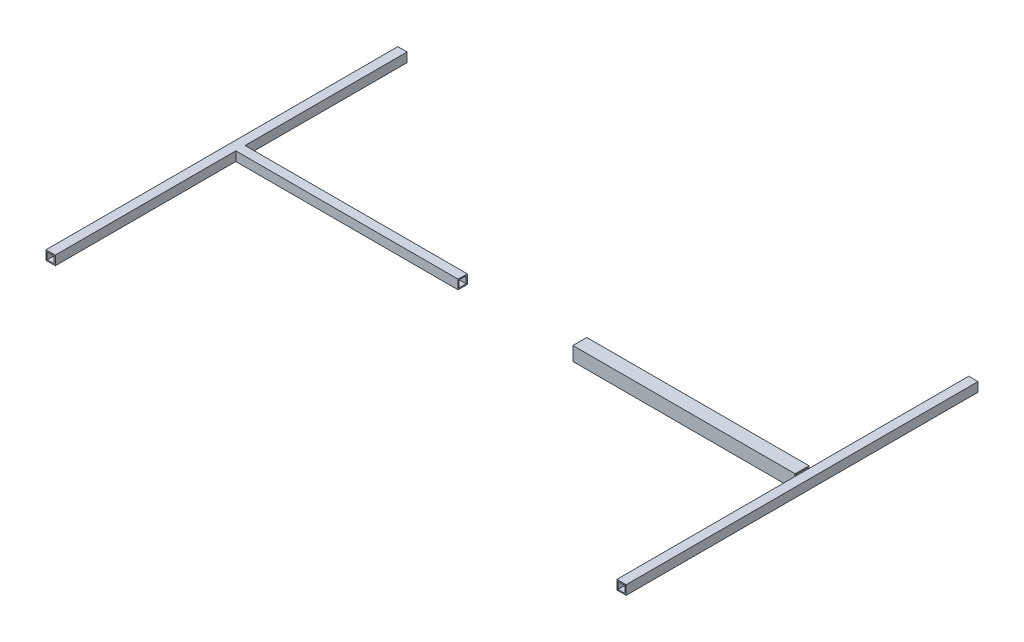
ISO-10303-21;
HEADER;
FILE_DESCRIPTION(('STEP AP214'),'2;1');
FILE_NAME('part.step','',(''),(''),'','','');
FILE_SCHEMA(('AUTOMOTIVE_DESIGN { 1 0 10303 214 1 1 1 1 }'));
ENDSEC;
DATA;
#1=APPLICATION_CONTEXT('core data for automotive mechanical design processes');
#2=APPLICATION_PROTOCOL_DEFINITION('international standard','automotive_design',2000,#1);
#3=PRODUCT_CONTEXT('',#1,'mechanical');
#4=PRODUCT('Part','Part','',(#3));
#5=PRODUCT_RELATED_PRODUCT_CATEGORY('part','',(#4));
#6=PRODUCT_DEFINITION_FORMATION('','',#4);
#7=PRODUCT_DEFINITION_CONTEXT('part definition',#1,'design');
#8=PRODUCT_DEFINITION('design','',#6,#7);
#9=PRODUCT_DEFINITION_SHAPE('','',#8);
#10=(LENGTH_UNIT() NAMED_UNIT(*) SI_UNIT(.MILLI.,.METRE.));
#11=(NAMED_UNIT(*) PLANE_ANGLE_UNIT() SI_UNIT($,.RADIAN.));
#12=(NAMED_UNIT(*) SI_UNIT($,.STERADIAN.) SOLID_ANGLE_UNIT());
#13=UNCERTAINTY_MEASURE_WITH_UNIT(LENGTH_MEASURE(1.E-05),#10,'distance_accuracy_value','');
#14=(GEOMETRIC_REPRESENTATION_CONTEXT(3) GLOBAL_UNCERTAINTY_ASSIGNED_CONTEXT((#13)) GLOBAL_UNIT_ASSIGNED_CONTEXT((#10,
#11,#12)) REPRESENTATION_CONTEXT('',''));
#15=CARTESIAN_POINT('',(0.,0.,0.));
#16=DIRECTION('',(0.,0.,1.));
#17=DIRECTION('',(1.,0.,0.));
#18=AXIS2_PLACEMENT_3D('',#15,#16,#17);
#19=CARTESIAN_POINT('',(-6.35000000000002,-6.35000000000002,-482.6));
#20=DIRECTION('',(-1.,0.,0.));
#21=DIRECTION('',(0.,0.,1.));
#22=AXIS2_PLACEMENT_3D('',#19,#20,#21);
#23=PLANE('',#22);
#24=DIRECTION('',(0.,1.,0.));
#25=VECTOR('',#24,1.);
#26=CARTESIAN_POINT('',(-6.35000000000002,0.,-261.9375));
#27=LINE('',#26,#25);
#28=CARTESIAN_POINT('',(-6.35000000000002,-6.35000000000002,-261.9375));
#29=VERTEX_POINT('',#28);
#30=CARTESIAN_POINT('',(-6.35000000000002,6.35000000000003,-261.9375));
#31=VERTEX_POINT('',#30);
#32=EDGE_CURVE('E13',#29,#31,#27,.T.);
#33=ORIENTED_EDGE('',*,*,#32,.F.);
#34=DIRECTION('',(0.,0.,1.));
#35=VECTOR('',#34,1.);
#36=CARTESIAN_POINT('',(-6.35000000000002,-6.35000000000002,-482.6));
#37=LINE('',#36,#35);
#38=CARTESIAN_POINT('',(-6.35000000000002,-6.35000000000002,-246.0625));
#39=VERTEX_POINT('',#38);
#40=EDGE_CURVE('E498',#29,#39,#37,.T.);
#41=ORIENTED_EDGE('',*,*,#40,.T.);
#42=DIRECTION('',(0.,1.,0.));
#43=VECTOR('',#42,1.);
#44=CARTESIAN_POINT('',(-6.35000000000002,0.,-246.0625));
#45=LINE('',#44,#43);
#46=CARTESIAN_POINT('',(-6.35000000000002,6.35000000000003,-246.0625));
#47=VERTEX_POINT('',#46);
#48=EDGE_CURVE('E89',#39,#47,#45,.T.);
#49=ORIENTED_EDGE('',*,*,#48,.T.);
#50=DIRECTION('',(0.,0.,1.));
#51=VECTOR('',#50,1.);
#52=CARTESIAN_POINT('',(-6.35000000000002,6.35000000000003,-482.6));
#53=LINE('',#52,#51);
#54=EDGE_CURVE('E499',#31,#47,#53,.T.);
#55=ORIENTED_EDGE('',*,*,#54,.F.);
#56=EDGE_LOOP('',(#33,#41,#49,#55));
#57=FACE_BOUND('',#56,.T.);
#58=ADVANCED_FACE('F79',(#57),#23,.T.);
#59=CARTESIAN_POINT('',(-6.35000000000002,-6.35000000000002,-482.6));
#60=VERTEX_POINT('',#59);
#61=CARTESIAN_POINT('',(-6.35000000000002,-6.35000000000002,-263.525));
#62=VERTEX_POINT('',#61);
#63=EDGE_CURVE('E336',#60,#62,#37,.T.);
#64=ORIENTED_EDGE('',*,*,#63,.T.);
#65=DIRECTION('',(0.,1.,0.));
#66=VECTOR('',#65,1.);
#67=CARTESIAN_POINT('',(-6.35000000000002,-9.52500000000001,-263.525));
#68=LINE('',#67,#66);
#69=CARTESIAN_POINT('',(-6.35000000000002,6.35000000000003,-263.525));
#70=VERTEX_POINT('',#69);
#71=EDGE_CURVE('E299',#62,#70,#68,.T.);
#72=ORIENTED_EDGE('',*,*,#71,.T.);
#73=CARTESIAN_POINT('',(-6.35000000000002,6.35000000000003,-482.6));
#74=VERTEX_POINT('',#73);
#75=EDGE_CURVE('E330',#74,#70,#53,.T.);
#76=ORIENTED_EDGE('',*,*,#75,.F.);
#77=DIRECTION('',(0.,-1.,0.));
#78=VECTOR('',#77,1.);
#79=CARTESIAN_POINT('',(-6.35000000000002,-6.35000000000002,-482.6));
#80=LINE('',#79,#78);
#81=EDGE_CURVE('E365',#74,#60,#80,.T.);
#82=ORIENTED_EDGE('',*,*,#81,.T.);
#83=EDGE_LOOP('',(#64,#72,#76,#82));
#84=FACE_BOUND('',#83,.T.);
#85=ADVANCED_FACE('F462',(#84),#23,.T.);
#86=CARTESIAN_POINT('',(6.35000000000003,-6.35000000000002,-482.6));
#87=DIRECTION('',(1.,0.,0.));
#88=DIRECTION('',(0.,0.,-1.));
#89=AXIS2_PLACEMENT_3D('',#86,#87,#88);
#90=PLANE('',#89);
#91=DIRECTION('',(0.,1.,0.));
#92=VECTOR('',#91,1.);
#93=CARTESIAN_POINT('',(6.35000000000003,-6.35000000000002,0.));
#94=LINE('',#93,#92);
#95=CARTESIAN_POINT('',(6.35000000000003,-6.35000000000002,0.));
#96=VERTEX_POINT('',#95);
#97=CARTESIAN_POINT('',(6.35000000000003,6.35000000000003,0.));
#98=VERTEX_POINT('',#97);
#99=EDGE_CURVE('E357',#96,#98,#94,.T.);
#100=ORIENTED_EDGE('',*,*,#99,.F.);
#101=DIRECTION('',(0.,0.,1.));
#102=VECTOR('',#101,1.);
#103=CARTESIAN_POINT('',(6.35000000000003,-6.35000000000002,-482.6));
#104=LINE('',#103,#102);
#105=CARTESIAN_POINT('',(6.35000000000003,-6.35000000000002,-482.6));
#106=VERTEX_POINT('',#105);
#107=EDGE_CURVE('E325',#106,#96,#104,.T.);
#108=ORIENTED_EDGE('',*,*,#107,.F.);
#109=DIRECTION('',(0.,1.,0.));
#110=VECTOR('',#109,1.);
#111=CARTESIAN_POINT('',(6.35000000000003,-6.35000000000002,-482.6));
#112=LINE('',#111,#110);
#113=CARTESIAN_POINT('',(6.35000000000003,6.35000000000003,-482.6));
#114=VERTEX_POINT('',#113);
#115=EDGE_CURVE('E349',#106,#114,#112,.T.);
#116=ORIENTED_EDGE('',*,*,#115,.T.);
#117=DIRECTION('',(0.,0.,1.));
#118=VECTOR('',#117,1.);
#119=CARTESIAN_POINT('',(6.35000000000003,6.35000000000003,-482.6));
#120=LINE('',#119,#118);
#121=EDGE_CURVE('E326',#114,#98,#120,.T.);
#122=ORIENTED_EDGE('',*,*,#121,.T.);
#123=EDGE_LOOP('',(#100,#108,#116,#122));
#124=FACE_BOUND('',#123,.T.);
#125=ADVANCED_FACE('F442',(#124),#90,.T.);
#126=CARTESIAN_POINT('',(-6.35000000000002,-6.35000000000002,-482.6));
#127=DIRECTION('',(0.,-1.,0.));
#128=DIRECTION('',(0.,0.,-1.));
#129=AXIS2_PLACEMENT_3D('',#126,#127,#128);
#130=PLANE('',#129);
#131=DIRECTION('',(1.,0.,0.));
#132=VECTOR('',#131,1.);
#133=CARTESIAN_POINT('',(-6.35000000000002,-6.35000000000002,0.));
#134=LINE('',#133,#132);
#135=CARTESIAN_POINT('',(-6.35000000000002,-6.35000000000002,0.));
#136=VERTEX_POINT('',#135);
#137=EDGE_CURVE('E344',#136,#96,#134,.T.);
#138=ORIENTED_EDGE('',*,*,#137,.F.);
#139=CARTESIAN_POINT('',(-6.35000000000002,-6.35000000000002,-244.475));
#140=VERTEX_POINT('',#139);
#141=EDGE_CURVE('E341',#140,#136,#37,.T.);
#142=ORIENTED_EDGE('',*,*,#141,.F.);
#143=EDGE_CURVE('E106',#39,#140,#37,.T.);
#144=ORIENTED_EDGE('',*,*,#143,.F.);
#145=ORIENTED_EDGE('',*,*,#40,.F.);
#146=EDGE_CURVE('E340',#62,#29,#37,.T.);
#147=ORIENTED_EDGE('',*,*,#146,.F.);
#148=ORIENTED_EDGE('',*,*,#63,.F.);
#149=DIRECTION('',(1.,0.,0.));
#150=VECTOR('',#149,1.);
#151=CARTESIAN_POINT('',(-6.35000000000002,-6.35000000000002,-482.6));
#152=LINE('',#151,#150);
#153=EDGE_CURVE('E329',#60,#106,#152,.T.);
#154=ORIENTED_EDGE('',*,*,#153,.T.);
#155=ORIENTED_EDGE('',*,*,#107,.T.);
#156=EDGE_LOOP('',(#138,#142,#144,#145,#147,#148,#154,#155));
#157=FACE_BOUND('',#156,.T.);
#158=ADVANCED_FACE('F454',(#157),#130,.T.);
#159=DIRECTION('',(0.,1.,0.));
#160=VECTOR('',#159,1.);
#161=CARTESIAN_POINT('',(-6.35000000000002,-9.52500000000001,-244.475));
#162=LINE('',#161,#160);
#163=CARTESIAN_POINT('',(-6.35000000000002,6.35000000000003,-244.475));
#164=VERTEX_POINT('',#163);
#165=EDGE_CURVE('E99',#140,#164,#162,.T.);
#166=ORIENTED_EDGE('',*,*,#165,.F.);
#167=ORIENTED_EDGE('',*,*,#141,.T.);
#168=DIRECTION('',(0.,-1.,0.));
#169=VECTOR('',#168,1.);
#170=CARTESIAN_POINT('',(-6.35000000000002,-6.35000000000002,0.));
#171=LINE('',#170,#169);
#172=CARTESIAN_POINT('',(-6.35000000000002,6.35000000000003,0.));
#173=VERTEX_POINT('',#172);
#174=EDGE_CURVE('E348',#173,#136,#171,.T.);
#175=ORIENTED_EDGE('',*,*,#174,.F.);
#176=EDGE_CURVE('E335',#164,#173,#53,.T.);
#177=ORIENTED_EDGE('',*,*,#176,.F.);
#178=EDGE_LOOP('',(#166,#167,#175,#177));
#179=FACE_BOUND('',#178,.T.);
#180=ADVANCED_FACE('F453',(#179),#23,.T.);
#181=CARTESIAN_POINT('',(-6.35000000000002,6.35000000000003,-482.6));
#182=DIRECTION('',(0.,1.,0.));
#183=DIRECTION('',(0.,0.,1.));
#184=AXIS2_PLACEMENT_3D('',#181,#182,#183);
#185=PLANE('',#184);
#186=DIRECTION('',(-1.,0.,0.));
#187=VECTOR('',#186,1.);
#188=CARTESIAN_POINT('',(-6.35000000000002,6.35000000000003,0.));
#189=LINE('',#188,#187);
#190=EDGE_CURVE('E353',#98,#173,#189,.T.);
#191=ORIENTED_EDGE('',*,*,#190,.F.);
#192=ORIENTED_EDGE('',*,*,#121,.F.);
#193=DIRECTION('',(-1.,0.,0.));
#194=VECTOR('',#193,1.);
#195=CARTESIAN_POINT('',(-6.35000000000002,6.35000000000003,-482.6));
#196=LINE('',#195,#194);
#197=EDGE_CURVE('E369',#114,#74,#196,.T.);
#198=ORIENTED_EDGE('',*,*,#197,.T.);
#199=ORIENTED_EDGE('',*,*,#75,.T.);
#200=EDGE_CURVE('E334',#70,#31,#53,.T.);
#201=ORIENTED_EDGE('',*,*,#200,.T.);
#202=ORIENTED_EDGE('',*,*,#54,.T.);
#203=EDGE_CURVE('E450',#47,#164,#53,.T.);
#204=ORIENTED_EDGE('',*,*,#203,.T.);
#205=ORIENTED_EDGE('',*,*,#176,.T.);
#206=EDGE_LOOP('',(#191,#192,#198,#199,#201,#202,#204,#205));
#207=FACE_BOUND('',#206,.T.);
#208=ADVANCED_FACE('F446',(#207),#185,.T.);
#209=CARTESIAN_POINT('',(0.,0.,-482.6));
#210=DIRECTION('',(0.,0.,-1.));
#211=DIRECTION('',(-1.,0.,0.));
#212=AXIS2_PLACEMENT_3D('',#209,#210,#211);
#213=PLANE('',#212);
#214=DIRECTION('',(0.,1.,0.));
#215=VECTOR('',#214,1.);
#216=CARTESIAN_POINT('',(4.76250000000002,-4.76250000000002,-482.6));
#217=LINE('',#216,#215);
#218=CARTESIAN_POINT('',(4.76250000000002,-4.76250000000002,-482.6));
#219=VERTEX_POINT('',#218);
#220=CARTESIAN_POINT('',(4.76250000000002,4.76250000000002,-482.6));
#221=VERTEX_POINT('',#220);
#222=EDGE_CURVE('E83',#219,#221,#217,.T.);
#223=ORIENTED_EDGE('',*,*,#222,.T.);
#224=DIRECTION('',(-1.,0.,0.));
#225=VECTOR('',#224,1.);
#226=CARTESIAN_POINT('',(-4.76250000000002,4.76250000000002,-482.6));
#227=LINE('',#226,#225);
#228=CARTESIAN_POINT('',(-4.76250000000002,4.76250000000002,-482.6));
#229=VERTEX_POINT('',#228);
#230=EDGE_CURVE('E410',#221,#229,#227,.T.);
#231=ORIENTED_EDGE('',*,*,#230,.T.);
#232=DIRECTION('',(0.,-1.,0.));
#233=VECTOR('',#232,1.);
#234=CARTESIAN_POINT('',(-4.76250000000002,-4.76250000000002,-482.6));
#235=LINE('',#234,#233);
#236=CARTESIAN_POINT('',(-4.76250000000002,-4.76250000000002,-482.6));
#237=VERTEX_POINT('',#236);
#238=EDGE_CURVE('E407',#229,#237,#235,.T.);
#239=ORIENTED_EDGE('',*,*,#238,.T.);
#240=DIRECTION('',(1.,0.,0.));
#241=VECTOR('',#240,1.);
#242=CARTESIAN_POINT('',(-4.76250000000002,-4.76250000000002,-482.6));
#243=LINE('',#242,#241);
#244=EDGE_CURVE('E380',#237,#219,#243,.T.);
#245=ORIENTED_EDGE('',*,*,#244,.T.);
#246=EDGE_LOOP('',(#223,#231,#239,#245));
#247=FACE_BOUND('',#246,.T.);
#248=ORIENTED_EDGE('',*,*,#115,.F.);
#249=ORIENTED_EDGE('',*,*,#153,.F.);
#250=ORIENTED_EDGE('',*,*,#81,.F.);
#251=ORIENTED_EDGE('',*,*,#197,.F.);
#252=EDGE_LOOP('',(#248,#249,#250,#251));
#253=FACE_BOUND('',#252,.T.);
#254=ADVANCED_FACE('F418',(#247,#253),#213,.T.);
#255=CARTESIAN_POINT('',(0.,0.,0.));
#256=DIRECTION('',(0.,0.,-1.));
#257=DIRECTION('',(-1.,0.,0.));
#258=AXIS2_PLACEMENT_3D('',#255,#256,#257);
#259=PLANE('',#258);
#260=DIRECTION('',(-1.,0.,0.));
#261=VECTOR('',#260,1.);
#262=CARTESIAN_POINT('',(-4.76250000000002,4.76250000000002,0.));
#263=LINE('',#262,#261);
#264=CARTESIAN_POINT('',(4.76250000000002,4.76250000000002,0.));
#265=VERTEX_POINT('',#264);
#266=CARTESIAN_POINT('',(-4.76250000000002,4.76250000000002,0.));
#267=VERTEX_POINT('',#266);
#268=EDGE_CURVE('E397',#265,#267,#263,.T.);
#269=ORIENTED_EDGE('',*,*,#268,.F.);
#270=DIRECTION('',(0.,1.,0.));
#271=VECTOR('',#270,1.);
#272=CARTESIAN_POINT('',(4.76250000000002,-4.76250000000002,0.));
#273=LINE('',#272,#271);
#274=CARTESIAN_POINT('',(4.76250000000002,-4.76250000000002,0.));
#275=VERTEX_POINT('',#274);
#276=EDGE_CURVE('E401',#275,#265,#273,.T.);
#277=ORIENTED_EDGE('',*,*,#276,.F.);
#278=DIRECTION('',(1.,0.,0.));
#279=VECTOR('',#278,1.);
#280=CARTESIAN_POINT('',(-4.76250000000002,-4.76250000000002,0.));
#281=LINE('',#280,#279);
#282=CARTESIAN_POINT('',(-4.76250000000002,-4.76250000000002,0.));
#283=VERTEX_POINT('',#282);
#284=EDGE_CURVE('E389',#283,#275,#281,.T.);
#285=ORIENTED_EDGE('',*,*,#284,.F.);
#286=DIRECTION('',(0.,-1.,0.));
#287=VECTOR('',#286,1.);
#288=CARTESIAN_POINT('',(-4.76250000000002,-4.76250000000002,0.));
#289=LINE('',#288,#287);
#290=EDGE_CURVE('E393',#267,#283,#289,.T.);
#291=ORIENTED_EDGE('',*,*,#290,.F.);
#292=EDGE_LOOP('',(#269,#277,#285,#291));
#293=FACE_BOUND('',#292,.T.);
#294=ORIENTED_EDGE('',*,*,#99,.T.);
#295=ORIENTED_EDGE('',*,*,#190,.T.);
#296=ORIENTED_EDGE('',*,*,#174,.T.);
#297=ORIENTED_EDGE('',*,*,#137,.T.);
#298=EDGE_LOOP('',(#294,#295,#296,#297));
#299=FACE_BOUND('',#298,.T.);
#300=ADVANCED_FACE('F434',(#293,#299),#259,.F.);
#301=CARTESIAN_POINT('',(4.76250000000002,-4.76250000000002,-482.6));
#302=DIRECTION('',(1.,0.,0.));
#303=DIRECTION('',(0.,0.,-1.));
#304=AXIS2_PLACEMENT_3D('',#301,#302,#303);
#305=PLANE('',#304);
#306=ORIENTED_EDGE('',*,*,#276,.T.);
#307=DIRECTION('',(0.,0.,1.));
#308=VECTOR('',#307,1.);
#309=CARTESIAN_POINT('',(4.76250000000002,4.76250000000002,-482.6));
#310=LINE('',#309,#308);
#311=EDGE_CURVE('E376',#221,#265,#310,.T.);
#312=ORIENTED_EDGE('',*,*,#311,.F.);
#313=ORIENTED_EDGE('',*,*,#222,.F.);
#314=DIRECTION('',(0.,0.,1.));
#315=VECTOR('',#314,1.);
#316=CARTESIAN_POINT('',(4.76250000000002,-4.76250000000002,-482.6));
#317=LINE('',#316,#315);
#318=EDGE_CURVE('E361',#219,#275,#317,.T.);
#319=ORIENTED_EDGE('',*,*,#318,.T.);
#320=EDGE_LOOP('',(#306,#312,#313,#319));
#321=FACE_BOUND('',#320,.T.);
#322=ADVANCED_FACE('F422',(#321),#305,.F.);
#323=CARTESIAN_POINT('',(-4.76250000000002,-4.76250000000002,-482.6));
#324=DIRECTION('',(0.,-1.,0.));
#325=DIRECTION('',(1.,0.,0.));
#326=AXIS2_PLACEMENT_3D('',#323,#324,#325);
#327=PLANE('',#326);
#328=ORIENTED_EDGE('',*,*,#284,.T.);
#329=ORIENTED_EDGE('',*,*,#318,.F.);
#330=ORIENTED_EDGE('',*,*,#244,.F.);
#331=DIRECTION('',(0.,0.,1.));
#332=VECTOR('',#331,1.);
#333=CARTESIAN_POINT('',(-4.76250000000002,-4.76250000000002,-482.6));
#334=LINE('',#333,#332);
#335=EDGE_CURVE('E384',#237,#283,#334,.T.);
#336=ORIENTED_EDGE('',*,*,#335,.T.);
#337=EDGE_LOOP('',(#328,#329,#330,#336));
#338=FACE_BOUND('',#337,.T.);
#339=ADVANCED_FACE('F81',(#338),#327,.F.);
#340=CARTESIAN_POINT('',(-4.76250000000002,-4.76250000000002,-482.6));
#341=DIRECTION('',(-1.,0.,0.));
#342=DIRECTION('',(0.,-1.,0.));
#343=AXIS2_PLACEMENT_3D('',#340,#341,#342);
#344=PLANE('',#343);
#345=ORIENTED_EDGE('',*,*,#290,.T.);
#346=ORIENTED_EDGE('',*,*,#335,.F.);
#347=ORIENTED_EDGE('',*,*,#238,.F.);
#348=DIRECTION('',(0.,0.,1.));
#349=VECTOR('',#348,1.);
#350=CARTESIAN_POINT('',(-4.76250000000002,4.76250000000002,-482.6));
#351=LINE('',#350,#349);
#352=EDGE_CURVE('E381',#229,#267,#351,.T.);
#353=ORIENTED_EDGE('',*,*,#352,.T.);
#354=EDGE_LOOP('',(#345,#346,#347,#353));
#355=FACE_BOUND('',#354,.T.);
#356=ADVANCED_FACE('F430',(#355),#344,.F.);
#357=CARTESIAN_POINT('',(-4.76250000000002,4.76250000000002,-482.6));
#358=DIRECTION('',(0.,1.,0.));
#359=DIRECTION('',(-1.,0.,0.));
#360=AXIS2_PLACEMENT_3D('',#357,#358,#359);
#361=PLANE('',#360);
#362=ORIENTED_EDGE('',*,*,#268,.T.);
#363=ORIENTED_EDGE('',*,*,#352,.F.);
#364=ORIENTED_EDGE('',*,*,#230,.F.);
#365=ORIENTED_EDGE('',*,*,#311,.T.);
#366=EDGE_LOOP('',(#362,#363,#364,#365));
#367=FACE_BOUND('',#366,.T.);
#368=ADVANCED_FACE('F427',(#367),#361,.F.);
#369=CARTESIAN_POINT('',(-6.35000000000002,0.,0.));
#370=DIRECTION('',(-1.,0.,0.));
#371=DIRECTION('',(0.,0.,1.));
#372=AXIS2_PLACEMENT_3D('',#369,#370,#371);
#373=PLANE('',#372);
#374=CARTESIAN_POINT('',(-6.35000000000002,-9.52500000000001,-263.525));
#375=VERTEX_POINT('',#374);
#376=EDGE_CURVE('E295',#375,#62,#68,.T.);
#377=ORIENTED_EDGE('',*,*,#376,.T.);
#378=ORIENTED_EDGE('',*,*,#146,.T.);
#379=CARTESIAN_POINT('',(-6.35000000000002,-7.9375,-261.9375));
#380=VERTEX_POINT('',#379);
#381=EDGE_CURVE('E91',#380,#29,#27,.T.);
#382=ORIENTED_EDGE('',*,*,#381,.F.);
#383=DIRECTION('',(0.,0.,1.));
#384=VECTOR('',#383,1.);
#385=CARTESIAN_POINT('',(-6.35000000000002,-7.9375,0.));
#386=LINE('',#385,#384);
#387=CARTESIAN_POINT('',(-6.35000000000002,-7.9375,-246.0625));
#388=VERTEX_POINT('',#387);
#389=EDGE_CURVE('E227',#380,#388,#386,.T.);
#390=ORIENTED_EDGE('',*,*,#389,.T.);
#391=EDGE_CURVE('E239',#388,#39,#45,.T.);
#392=ORIENTED_EDGE('',*,*,#391,.T.);
#393=ORIENTED_EDGE('',*,*,#143,.T.);
#394=CARTESIAN_POINT('',(-6.35000000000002,-9.52500000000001,-244.475));
#395=VERTEX_POINT('',#394);
#396=EDGE_CURVE('E286',#395,#140,#162,.T.);
#397=ORIENTED_EDGE('',*,*,#396,.F.);
#398=DIRECTION('',(0.,0.,1.));
#399=VECTOR('',#398,1.);
#400=CARTESIAN_POINT('',(-6.35000000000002,-9.52500000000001,-263.525));
#401=LINE('',#400,#399);
#402=EDGE_CURVE('E290',#375,#395,#401,.T.);
#403=ORIENTED_EDGE('',*,*,#402,.F.);
#404=EDGE_LOOP('',(#377,#378,#382,#390,#392,#393,#397,#403));
#405=FACE_BOUND('',#404,.T.);
#406=ADVANCED_FACE('F248',(#405),#373,.F.);
#407=CARTESIAN_POINT('',(-6.35000000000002,9.52500000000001,-263.525));
#408=DIRECTION('',(0.,-1.,0.));
#409=DIRECTION('',(0.,0.,-1.));
#410=AXIS2_PLACEMENT_3D('',#407,#408,#409);
#411=PLANE('',#410);
#412=DIRECTION('',(0.,0.,1.));
#413=VECTOR('',#412,1.);
#414=CARTESIAN_POINT('',(-311.15,9.52500000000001,-263.525));
#415=LINE('',#414,#413);
#416=CARTESIAN_POINT('',(-311.15,9.52500000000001,-263.525));
#417=VERTEX_POINT('',#416);
#418=CARTESIAN_POINT('',(-311.15,9.52500000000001,-244.475));
#419=VERTEX_POINT('',#418);
#420=EDGE_CURVE('E274',#417,#419,#415,.T.);
#421=ORIENTED_EDGE('',*,*,#420,.T.);
#422=DIRECTION('',(-1.,0.,0.));
#423=VECTOR('',#422,1.);
#424=CARTESIAN_POINT('',(-6.35000000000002,9.52500000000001,-244.475));
#425=LINE('',#424,#423);
#426=CARTESIAN_POINT('',(-6.35000000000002,9.52500000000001,-244.475));
#427=VERTEX_POINT('',#426);
#428=EDGE_CURVE('E322',#427,#419,#425,.T.);
#429=ORIENTED_EDGE('',*,*,#428,.F.);
#430=DIRECTION('',(0.,0.,1.));
#431=VECTOR('',#430,1.);
#432=CARTESIAN_POINT('',(-6.35000000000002,9.52500000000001,-263.525));
#433=LINE('',#432,#431);
#434=CARTESIAN_POINT('',(-6.35000000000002,9.52500000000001,-263.525));
#435=VERTEX_POINT('',#434);
#436=EDGE_CURVE('E280',#435,#427,#433,.T.);
#437=ORIENTED_EDGE('',*,*,#436,.F.);
#438=DIRECTION('',(-1.,0.,0.));
#439=VECTOR('',#438,1.);
#440=CARTESIAN_POINT('',(-6.35000000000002,9.52500000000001,-263.525));
#441=LINE('',#440,#439);
#442=EDGE_CURVE('E298',#435,#417,#441,.T.);
#443=ORIENTED_EDGE('',*,*,#442,.T.);
#444=EDGE_LOOP('',(#421,#429,#437,#443));
#445=FACE_BOUND('',#444,.T.);
#446=ADVANCED_FACE('F477',(#445),#411,.F.);
#447=CARTESIAN_POINT('',(-6.35000000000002,-9.52500000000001,-244.475));
#448=DIRECTION('',(0.,0.,1.));
#449=DIRECTION('',(1.,0.,0.));
#450=AXIS2_PLACEMENT_3D('',#447,#448,#449);
#451=PLANE('',#450);
#452=DIRECTION('',(0.,1.,0.));
#453=VECTOR('',#452,1.);
#454=CARTESIAN_POINT('',(-311.15,-9.52500000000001,-244.475));
#455=LINE('',#454,#453);
#456=CARTESIAN_POINT('',(-311.15,-9.52500000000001,-244.475));
#457=VERTEX_POINT('',#456);
#458=EDGE_CURVE('E303',#457,#419,#455,.T.);
#459=ORIENTED_EDGE('',*,*,#458,.F.);
#460=DIRECTION('',(-1.,0.,0.));
#461=VECTOR('',#460,1.);
#462=CARTESIAN_POINT('',(-6.35000000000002,-9.52500000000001,-244.475));
#463=LINE('',#462,#461);
#464=EDGE_CURVE('E319',#395,#457,#463,.T.);
#465=ORIENTED_EDGE('',*,*,#464,.F.);
#466=ORIENTED_EDGE('',*,*,#396,.T.);
#467=ORIENTED_EDGE('',*,*,#165,.T.);
#468=EDGE_CURVE('E284',#164,#427,#162,.T.);
#469=ORIENTED_EDGE('',*,*,#468,.T.);
#470=ORIENTED_EDGE('',*,*,#428,.T.);
#471=EDGE_LOOP('',(#459,#465,#466,#467,#469,#470));
#472=FACE_BOUND('',#471,.T.);
#473=ADVANCED_FACE('F480',(#472),#451,.T.);
#474=CARTESIAN_POINT('',(-6.35000000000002,-9.52500000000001,-263.525));
#475=DIRECTION('',(0.,-1.,0.));
#476=DIRECTION('',(0.,0.,-1.));
#477=AXIS2_PLACEMENT_3D('',#474,#475,#476);
#478=PLANE('',#477);
#479=DIRECTION('',(0.,0.,1.));
#480=VECTOR('',#479,1.);
#481=CARTESIAN_POINT('',(-311.15,-9.52500000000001,-263.525));
#482=LINE('',#481,#480);
#483=CARTESIAN_POINT('',(-311.15,-9.52500000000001,-263.525));
#484=VERTEX_POINT('',#483);
#485=EDGE_CURVE('E307',#484,#457,#482,.T.);
#486=ORIENTED_EDGE('',*,*,#485,.F.);
#487=DIRECTION('',(-1.,0.,0.));
#488=VECTOR('',#487,1.);
#489=CARTESIAN_POINT('',(-6.35000000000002,-9.52500000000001,-263.525));
#490=LINE('',#489,#488);
#491=EDGE_CURVE('E316',#375,#484,#490,.T.);
#492=ORIENTED_EDGE('',*,*,#491,.F.);
#493=ORIENTED_EDGE('',*,*,#402,.T.);
#494=ORIENTED_EDGE('',*,*,#464,.T.);
#495=EDGE_LOOP('',(#486,#492,#493,#494));
#496=FACE_BOUND('',#495,.T.);
#497=ADVANCED_FACE('F508',(#496),#478,.T.);
#498=CARTESIAN_POINT('',(-6.35000000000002,-9.52500000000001,-263.525));
#499=DIRECTION('',(0.,0.,1.));
#500=DIRECTION('',(1.,0.,0.));
#501=AXIS2_PLACEMENT_3D('',#498,#499,#500);
#502=PLANE('',#501);
#503=DIRECTION('',(0.,1.,0.));
#504=VECTOR('',#503,1.);
#505=CARTESIAN_POINT('',(-311.15,-9.52500000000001,-263.525));
#506=LINE('',#505,#504);
#507=EDGE_CURVE('E285',#484,#417,#506,.T.);
#508=ORIENTED_EDGE('',*,*,#507,.T.);
#509=ORIENTED_EDGE('',*,*,#442,.F.);
#510=EDGE_CURVE('E294',#70,#435,#68,.T.);
#511=ORIENTED_EDGE('',*,*,#510,.F.);
#512=ORIENTED_EDGE('',*,*,#71,.F.);
#513=ORIENTED_EDGE('',*,*,#376,.F.);
#514=ORIENTED_EDGE('',*,*,#491,.T.);
#515=EDGE_LOOP('',(#508,#509,#511,#512,#513,#514));
#516=FACE_BOUND('',#515,.T.);
#517=ADVANCED_FACE('F473',(#516),#502,.F.);
#518=ORIENTED_EDGE('',*,*,#200,.F.);
#519=ORIENTED_EDGE('',*,*,#510,.T.);
#520=ORIENTED_EDGE('',*,*,#436,.T.);
#521=ORIENTED_EDGE('',*,*,#468,.F.);
#522=ORIENTED_EDGE('',*,*,#203,.F.);
#523=CARTESIAN_POINT('',(-6.35000000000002,7.93749999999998,-246.0625));
#524=VERTEX_POINT('',#523);
#525=EDGE_CURVE('E245',#47,#524,#45,.T.);
#526=ORIENTED_EDGE('',*,*,#525,.T.);
#527=DIRECTION('',(0.,0.,1.));
#528=VECTOR('',#527,1.);
#529=CARTESIAN_POINT('',(-6.35000000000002,7.93749999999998,0.));
#530=LINE('',#529,#528);
#531=CARTESIAN_POINT('',(-6.35000000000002,7.93749999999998,-261.9375));
#532=VERTEX_POINT('',#531);
#533=EDGE_CURVE('E244',#532,#524,#530,.T.);
#534=ORIENTED_EDGE('',*,*,#533,.F.);
#535=EDGE_CURVE('E92',#31,#532,#27,.T.);
#536=ORIENTED_EDGE('',*,*,#535,.F.);
#537=EDGE_LOOP('',(#518,#519,#520,#521,#522,#526,#534,#536));
#538=FACE_BOUND('',#537,.T.);
#539=ADVANCED_FACE('F470',(#538),#373,.F.);
#540=CARTESIAN_POINT('',(-311.15,0.,0.));
#541=DIRECTION('',(-1.,0.,0.));
#542=DIRECTION('',(0.,0.,1.));
#543=AXIS2_PLACEMENT_3D('',#540,#541,#542);
#544=PLANE('',#543);
#545=DIRECTION('',(0.,0.,1.));
#546=VECTOR('',#545,1.);
#547=CARTESIAN_POINT('',(-311.15,-7.9375,0.));
#548=LINE('',#547,#546);
#549=CARTESIAN_POINT('',(-311.15,-7.9375,-261.9375));
#550=VERTEX_POINT('',#549);
#551=CARTESIAN_POINT('',(-311.15,-7.9375,-246.0625));
#552=VERTEX_POINT('',#551);
#553=EDGE_CURVE('E230',#550,#552,#548,.T.);
#554=ORIENTED_EDGE('',*,*,#553,.F.);
#555=DIRECTION('',(0.,1.,0.));
#556=VECTOR('',#555,1.);
#557=CARTESIAN_POINT('',(-311.15,0.,-261.9375));
#558=LINE('',#557,#556);
#559=CARTESIAN_POINT('',(-311.15,7.93749999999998,-261.9375));
#560=VERTEX_POINT('',#559);
#561=EDGE_CURVE('E251',#550,#560,#558,.T.);
#562=ORIENTED_EDGE('',*,*,#561,.T.);
#563=DIRECTION('',(0.,0.,1.));
#564=VECTOR('',#563,1.);
#565=CARTESIAN_POINT('',(-311.15,7.93749999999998,0.));
#566=LINE('',#565,#564);
#567=CARTESIAN_POINT('',(-311.15,7.93749999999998,-246.0625));
#568=VERTEX_POINT('',#567);
#569=EDGE_CURVE('E256',#560,#568,#566,.T.);
#570=ORIENTED_EDGE('',*,*,#569,.T.);
#571=DIRECTION('',(0.,1.,0.));
#572=VECTOR('',#571,1.);
#573=CARTESIAN_POINT('',(-311.15,0.,-246.0625));
#574=LINE('',#573,#572);
#575=EDGE_CURVE('E265',#552,#568,#574,.T.);
#576=ORIENTED_EDGE('',*,*,#575,.F.);
#577=EDGE_LOOP('',(#554,#562,#570,#576));
#578=FACE_BOUND('',#577,.T.);
#579=ORIENTED_EDGE('',*,*,#420,.F.);
#580=ORIENTED_EDGE('',*,*,#507,.F.);
#581=ORIENTED_EDGE('',*,*,#485,.T.);
#582=ORIENTED_EDGE('',*,*,#458,.T.);
#583=EDGE_LOOP('',(#579,#580,#581,#582));
#584=FACE_BOUND('',#583,.T.);
#585=ADVANCED_FACE('F495',(#578,#584),#544,.T.);
#586=CARTESIAN_POINT('',(-6.35000000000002,-7.9375,0.));
#587=DIRECTION('',(0.,-1.,0.));
#588=DIRECTION('',(0.,0.,-1.));
#589=AXIS2_PLACEMENT_3D('',#586,#587,#588);
#590=PLANE('',#589);
#591=ORIENTED_EDGE('',*,*,#553,.T.);
#592=DIRECTION('',(-1.,0.,0.));
#593=VECTOR('',#592,1.);
#594=CARTESIAN_POINT('',(-6.35000000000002,-7.9375,-246.0625));
#595=LINE('',#594,#593);
#596=EDGE_CURVE('E223',#388,#552,#595,.T.);
#597=ORIENTED_EDGE('',*,*,#596,.F.);
#598=ORIENTED_EDGE('',*,*,#389,.F.);
#599=DIRECTION('',(-1.,0.,0.));
#600=VECTOR('',#599,1.);
#601=CARTESIAN_POINT('',(-6.35000000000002,-7.9375,-261.9375));
#602=LINE('',#601,#600);
#603=EDGE_CURVE('E271',#380,#550,#602,.T.);
#604=ORIENTED_EDGE('',*,*,#603,.T.);
#605=EDGE_LOOP('',(#591,#597,#598,#604));
#606=FACE_BOUND('',#605,.T.);
#607=ADVANCED_FACE('F225',(#606),#590,.F.);
#608=CARTESIAN_POINT('',(-6.35000000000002,0.,-261.9375));
#609=DIRECTION('',(0.,0.,1.));
#610=DIRECTION('',(1.,0.,0.));
#611=AXIS2_PLACEMENT_3D('',#608,#609,#610);
#612=PLANE('',#611);
#613=ORIENTED_EDGE('',*,*,#561,.F.);
#614=ORIENTED_EDGE('',*,*,#603,.F.);
#615=ORIENTED_EDGE('',*,*,#381,.T.);
#616=ORIENTED_EDGE('',*,*,#32,.T.);
#617=ORIENTED_EDGE('',*,*,#535,.T.);
#618=DIRECTION('',(-1.,0.,0.));
#619=VECTOR('',#618,1.);
#620=CARTESIAN_POINT('',(-6.35000000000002,7.93749999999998,-261.9375));
#621=LINE('',#620,#619);
#622=EDGE_CURVE('E275',#532,#560,#621,.T.);
#623=ORIENTED_EDGE('',*,*,#622,.T.);
#624=EDGE_LOOP('',(#613,#614,#615,#616,#617,#623));
#625=FACE_BOUND('',#624,.T.);
#626=ADVANCED_FACE('F486',(#625),#612,.T.);
#627=CARTESIAN_POINT('',(-6.35000000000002,7.93749999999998,0.));
#628=DIRECTION('',(0.,-1.,0.));
#629=DIRECTION('',(0.,0.,-1.));
#630=AXIS2_PLACEMENT_3D('',#627,#628,#629);
#631=PLANE('',#630);
#632=ORIENTED_EDGE('',*,*,#569,.F.);
#633=ORIENTED_EDGE('',*,*,#622,.F.);
#634=ORIENTED_EDGE('',*,*,#533,.T.);
#635=DIRECTION('',(-1.,0.,0.));
#636=VECTOR('',#635,1.);
#637=CARTESIAN_POINT('',(-6.35000000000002,7.93749999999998,-246.0625));
#638=LINE('',#637,#636);
#639=EDGE_CURVE('E235',#524,#568,#638,.T.);
#640=ORIENTED_EDGE('',*,*,#639,.T.);
#641=EDGE_LOOP('',(#632,#633,#634,#640));
#642=FACE_BOUND('',#641,.T.);
#643=ADVANCED_FACE('F492',(#642),#631,.T.);
#644=CARTESIAN_POINT('',(-6.35000000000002,0.,-246.0625));
#645=DIRECTION('',(0.,0.,1.));
#646=DIRECTION('',(1.,0.,0.));
#647=AXIS2_PLACEMENT_3D('',#644,#645,#646);
#648=PLANE('',#647);
#649=ORIENTED_EDGE('',*,*,#575,.T.);
#650=ORIENTED_EDGE('',*,*,#639,.F.);
#651=ORIENTED_EDGE('',*,*,#525,.F.);
#652=ORIENTED_EDGE('',*,*,#48,.F.);
#653=ORIENTED_EDGE('',*,*,#391,.F.);
#654=ORIENTED_EDGE('',*,*,#596,.T.);
#655=EDGE_LOOP('',(#649,#650,#651,#652,#653,#654));
#656=FACE_BOUND('',#655,.T.);
#657=ADVANCED_FACE('F240',(#656),#648,.F.);
#658=CLOSED_SHELL('',(#58,#85,#125,#158,#180,#208,#254,#300,#322,#339,#356,#368,#406,#446,#473,
#497,#517,#539,#585,#607,#626,#643,#657));
#659=MANIFOLD_SOLID_BREP('B2',#658);
#660=CARTESIAN_POINT('',(-776.693443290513,-6.34999999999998,-482.6));
#661=DIRECTION('',(1.,0.,0.));
#662=DIRECTION('',(0.,0.,-1.));
#663=AXIS2_PLACEMENT_3D('',#660,#661,#662);
#664=PLANE('',#663);
#665=DIRECTION('',(0.,1.,0.));
#666=VECTOR('',#665,1.);
#667=CARTESIAN_POINT('',(-776.693443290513,-6.35000000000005,-260.35));
#668=LINE('',#667,#666);
#669=CARTESIAN_POINT('',(-776.693443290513,-6.34999999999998,-260.35));
#670=VERTEX_POINT('',#669);
#671=CARTESIAN_POINT('',(-776.693443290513,6.35000000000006,-260.35));
#672=VERTEX_POINT('',#671);
#673=EDGE_CURVE('E892',#670,#672,#668,.T.);
#674=ORIENTED_EDGE('',*,*,#673,.F.);
#675=DIRECTION('',(0.,0.,1.));
#676=VECTOR('',#675,1.);
#677=CARTESIAN_POINT('',(-776.693443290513,-6.34999999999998,-482.6));
#678=LINE('',#677,#676);
#679=CARTESIAN_POINT('',(-776.693443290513,-6.34999999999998,-482.6));
#680=VERTEX_POINT('',#679);
#681=EDGE_CURVE('E77',#680,#670,#678,.T.);
#682=ORIENTED_EDGE('',*,*,#681,.F.);
#683=DIRECTION('',(0.,1.,0.));
#684=VECTOR('',#683,1.);
#685=CARTESIAN_POINT('',(-776.693443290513,-6.34999999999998,-482.6));
#686=LINE('',#685,#684);
#687=CARTESIAN_POINT('',(-776.693443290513,6.35000000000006,-482.6));
#688=VERTEX_POINT('',#687);
#689=EDGE_CURVE('E948',#680,#688,#686,.T.);
#690=ORIENTED_EDGE('',*,*,#689,.T.);
#691=DIRECTION('',(0.,0.,1.));
#692=VECTOR('',#691,1.);
#693=CARTESIAN_POINT('',(-776.693443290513,6.35000000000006,-482.6));
#694=LINE('',#693,#692);
#695=EDGE_CURVE('E742',#688,#672,#694,.T.);
#696=ORIENTED_EDGE('',*,*,#695,.T.);
#697=EDGE_LOOP('',(#674,#682,#690,#696));
#698=FACE_BOUND('',#697,.T.);
#699=ADVANCED_FACE('F738',(#698),#664,.T.);
#700=DIRECTION('',(0.,-1.,0.));
#701=VECTOR('',#700,1.);
#702=CARTESIAN_POINT('',(-776.693443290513,-6.35000000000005,-247.65));
#703=LINE('',#702,#701);
#704=CARTESIAN_POINT('',(-776.693443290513,6.35000000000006,-247.65));
#705=VERTEX_POINT('',#704);
#706=CARTESIAN_POINT('',(-776.693443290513,-6.35000000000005,-247.65));
#707=VERTEX_POINT('',#706);
#708=EDGE_CURVE('E763',#705,#707,#703,.T.);
#709=ORIENTED_EDGE('',*,*,#708,.F.);
#710=CARTESIAN_POINT('',(-776.693443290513,6.35000000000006,0.));
#711=VERTEX_POINT('',#710);
#712=EDGE_CURVE('E961',#705,#711,#694,.T.);
#713=ORIENTED_EDGE('',*,*,#712,.T.);
#714=DIRECTION('',(0.,1.,0.));
#715=VECTOR('',#714,1.);
#716=CARTESIAN_POINT('',(-776.693443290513,-6.34999999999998,0.));
#717=LINE('',#716,#715);
#718=CARTESIAN_POINT('',(-776.693443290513,-6.34999999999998,0.));
#719=VERTEX_POINT('',#718);
#720=EDGE_CURVE('E941',#719,#711,#717,.T.);
#721=ORIENTED_EDGE('',*,*,#720,.F.);
#722=EDGE_CURVE('E747',#707,#719,#678,.T.);
#723=ORIENTED_EDGE('',*,*,#722,.F.);
#724=EDGE_LOOP('',(#709,#713,#721,#723));
#725=FACE_BOUND('',#724,.T.);
#726=ADVANCED_FACE('F740',(#725),#664,.T.);
#727=CARTESIAN_POINT('',(-789.393443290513,-6.34999999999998,-482.6));
#728=DIRECTION('',(0.,-1.,0.));
#729=DIRECTION('',(0.,0.,-1.));
#730=AXIS2_PLACEMENT_3D('',#727,#728,#729);
#731=PLANE('',#730);
#732=DIRECTION('',(1.,0.,0.));
#733=VECTOR('',#732,1.);
#734=CARTESIAN_POINT('',(-789.393443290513,-6.34999999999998,0.));
#735=LINE('',#734,#733);
#736=CARTESIAN_POINT('',(-789.393443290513,-6.34999999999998,0.));
#737=VERTEX_POINT('',#736);
#738=EDGE_CURVE('E952',#737,#719,#735,.T.);
#739=ORIENTED_EDGE('',*,*,#738,.F.);
#740=DIRECTION('',(0.,0.,1.));
#741=VECTOR('',#740,1.);
#742=CARTESIAN_POINT('',(-789.393443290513,-6.34999999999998,-482.6));
#743=LINE('',#742,#741);
#744=CARTESIAN_POINT('',(-789.393443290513,-6.34999999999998,-482.6));
#745=VERTEX_POINT('',#744);
#746=EDGE_CURVE('E972',#745,#737,#743,.T.);
#747=ORIENTED_EDGE('',*,*,#746,.F.);
#748=DIRECTION('',(1.,0.,0.));
#749=VECTOR('',#748,1.);
#750=CARTESIAN_POINT('',(-789.393443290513,-6.34999999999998,-482.6));
#751=LINE('',#750,#749);
#752=EDGE_CURVE('E958',#745,#680,#751,.T.);
#753=ORIENTED_EDGE('',*,*,#752,.T.);
#754=ORIENTED_EDGE('',*,*,#681,.T.);
#755=DIRECTION('',(1.,0.,0.));
#756=VECTOR('',#755,1.);
#757=CARTESIAN_POINT('',(-776.693443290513,-6.35000000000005,-260.35));
#758=LINE('',#757,#756);
#759=CARTESIAN_POINT('',(-471.893443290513,-6.35000000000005,-260.35));
#760=VERTEX_POINT('',#759);
#761=EDGE_CURVE('E908',#670,#760,#758,.T.);
#762=ORIENTED_EDGE('',*,*,#761,.T.);
#763=DIRECTION('',(0.,0.,-1.));
#764=VECTOR('',#763,1.);
#765=CARTESIAN_POINT('',(-471.893443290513,-6.35000000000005,-247.65));
#766=LINE('',#765,#764);
#767=CARTESIAN_POINT('',(-471.893443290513,-6.35000000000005,-247.65));
#768=VERTEX_POINT('',#767);
#769=EDGE_CURVE('E895',#768,#760,#766,.T.);
#770=ORIENTED_EDGE('',*,*,#769,.F.);
#771=DIRECTION('',(1.,0.,0.));
#772=VECTOR('',#771,1.);
#773=CARTESIAN_POINT('',(-776.693443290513,-6.35000000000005,-247.65));
#774=LINE('',#773,#772);
#775=EDGE_CURVE('E911',#707,#768,#774,.T.);
#776=ORIENTED_EDGE('',*,*,#775,.F.);
#777=ORIENTED_EDGE('',*,*,#722,.T.);
#778=EDGE_LOOP('',(#739,#747,#753,#754,#762,#770,#776,#777));
#779=FACE_BOUND('',#778,.T.);
#780=ADVANCED_FACE('F986',(#779),#731,.T.);
#781=CARTESIAN_POINT('',(-789.393443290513,-6.34999999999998,-482.6));
#782=DIRECTION('',(-1.,0.,0.));
#783=DIRECTION('',(0.,0.,1.));
#784=AXIS2_PLACEMENT_3D('',#781,#782,#783);
#785=PLANE('',#784);
#786=DIRECTION('',(0.,-1.,0.));
#787=VECTOR('',#786,1.);
#788=CARTESIAN_POINT('',(-789.393443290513,-6.34999999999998,0.));
#789=LINE('',#788,#787);
#790=CARTESIAN_POINT('',(-789.393443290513,6.35000000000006,0.));
#791=VERTEX_POINT('',#790);
#792=EDGE_CURVE('E967',#791,#737,#789,.T.);
#793=ORIENTED_EDGE('',*,*,#792,.F.);
#794=DIRECTION('',(0.,0.,1.));
#795=VECTOR('',#794,1.);
#796=CARTESIAN_POINT('',(-789.393443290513,6.35000000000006,-482.6));
#797=LINE('',#796,#795);
#798=CARTESIAN_POINT('',(-789.393443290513,6.35000000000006,-482.6));
#799=VERTEX_POINT('',#798);
#800=EDGE_CURVE('E973',#799,#791,#797,.T.);
#801=ORIENTED_EDGE('',*,*,#800,.F.);
#802=DIRECTION('',(0.,-1.,0.));
#803=VECTOR('',#802,1.);
#804=CARTESIAN_POINT('',(-789.393443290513,-6.34999999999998,-482.6));
#805=LINE('',#804,#803);
#806=EDGE_CURVE('E955',#799,#745,#805,.T.);
#807=ORIENTED_EDGE('',*,*,#806,.T.);
#808=ORIENTED_EDGE('',*,*,#746,.T.);
#809=EDGE_LOOP('',(#793,#801,#807,#808));
#810=FACE_BOUND('',#809,.T.);
#811=ADVANCED_FACE('F1006',(#810),#785,.T.);
#812=CARTESIAN_POINT('',(-789.393443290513,6.35000000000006,-482.6));
#813=DIRECTION('',(0.,1.,0.));
#814=DIRECTION('',(0.,0.,1.));
#815=AXIS2_PLACEMENT_3D('',#812,#813,#814);
#816=PLANE('',#815);
#817=DIRECTION('',(-1.,0.,0.));
#818=VECTOR('',#817,1.);
#819=CARTESIAN_POINT('',(-789.393443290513,6.35000000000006,0.));
#820=LINE('',#819,#818);
#821=EDGE_CURVE('E964',#711,#791,#820,.T.);
#822=ORIENTED_EDGE('',*,*,#821,.F.);
#823=ORIENTED_EDGE('',*,*,#712,.F.);
#824=DIRECTION('',(1.,0.,0.));
#825=VECTOR('',#824,1.);
#826=CARTESIAN_POINT('',(-776.693443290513,6.35000000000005,-247.65));
#827=LINE('',#826,#825);
#828=CARTESIAN_POINT('',(-471.893443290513,6.35000000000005,-247.65));
#829=VERTEX_POINT('',#828);
#830=EDGE_CURVE('E913',#705,#829,#827,.T.);
#831=ORIENTED_EDGE('',*,*,#830,.T.);
#832=DIRECTION('',(0.,0.,1.));
#833=VECTOR('',#832,1.);
#834=CARTESIAN_POINT('',(-471.893443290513,6.35000000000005,-247.65));
#835=LINE('',#834,#833);
#836=CARTESIAN_POINT('',(-471.893443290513,6.35000000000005,-260.35));
#837=VERTEX_POINT('',#836);
#838=EDGE_CURVE('E900',#837,#829,#835,.T.);
#839=ORIENTED_EDGE('',*,*,#838,.F.);
#840=DIRECTION('',(1.,0.,0.));
#841=VECTOR('',#840,1.);
#842=CARTESIAN_POINT('',(-776.693443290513,6.35000000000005,-260.35));
#843=LINE('',#842,#841);
#844=EDGE_CURVE('E897',#672,#837,#843,.T.);
#845=ORIENTED_EDGE('',*,*,#844,.F.);
#846=ORIENTED_EDGE('',*,*,#695,.F.);
#847=DIRECTION('',(-1.,0.,0.));
#848=VECTOR('',#847,1.);
#849=CARTESIAN_POINT('',(-789.393443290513,6.35000000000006,-482.6));
#850=LINE('',#849,#848);
#851=EDGE_CURVE('E951',#688,#799,#850,.T.);
#852=ORIENTED_EDGE('',*,*,#851,.T.);
#853=ORIENTED_EDGE('',*,*,#800,.T.);
#854=EDGE_LOOP('',(#822,#823,#831,#839,#845,#846,#852,#853));
#855=FACE_BOUND('',#854,.T.);
#856=ADVANCED_FACE('F981',(#855),#816,.T.);
#857=CARTESIAN_POINT('',(0.,0.,-482.6));
#858=DIRECTION('',(0.,0.,-1.));
#859=DIRECTION('',(-1.,0.,0.));
#860=AXIS2_PLACEMENT_3D('',#857,#858,#859);
#861=PLANE('',#860);
#862=DIRECTION('',(0.,1.,0.));
#863=VECTOR('',#862,1.);
#864=CARTESIAN_POINT('',(-778.280943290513,-4.76249999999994,-482.6));
#865=LINE('',#864,#863);
#866=CARTESIAN_POINT('',(-778.280943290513,-4.76249999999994,-482.6));
#867=VERTEX_POINT('',#866);
#868=CARTESIAN_POINT('',(-778.280943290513,4.76250000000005,-482.6));
#869=VERTEX_POINT('',#868);
#870=EDGE_CURVE('E916',#867,#869,#865,.T.);
#871=ORIENTED_EDGE('',*,*,#870,.T.);
#872=DIRECTION('',(-1.,0.,0.));
#873=VECTOR('',#872,1.);
#874=CARTESIAN_POINT('',(-787.805943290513,4.76250000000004,-482.6));
#875=LINE('',#874,#873);
#876=CARTESIAN_POINT('',(-787.805943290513,4.76250000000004,-482.6));
#877=VERTEX_POINT('',#876);
#878=EDGE_CURVE('E919',#869,#877,#875,.T.);
#879=ORIENTED_EDGE('',*,*,#878,.T.);
#880=DIRECTION('',(0.,-1.,0.));
#881=VECTOR('',#880,1.);
#882=CARTESIAN_POINT('',(-787.805943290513,-4.76249999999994,-482.6));
#883=LINE('',#882,#881);
#884=CARTESIAN_POINT('',(-787.805943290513,-4.76249999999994,-482.6));
#885=VERTEX_POINT('',#884);
#886=EDGE_CURVE('E923',#877,#885,#883,.T.);
#887=ORIENTED_EDGE('',*,*,#886,.T.);
#888=DIRECTION('',(1.,0.,0.));
#889=VECTOR('',#888,1.);
#890=CARTESIAN_POINT('',(-787.805943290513,-4.76249999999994,-482.6));
#891=LINE('',#890,#889);
#892=EDGE_CURVE('E926',#885,#867,#891,.T.);
#893=ORIENTED_EDGE('',*,*,#892,.T.);
#894=EDGE_LOOP('',(#871,#879,#887,#893));
#895=FACE_BOUND('',#894,.T.);
#896=ORIENTED_EDGE('',*,*,#689,.F.);
#897=ORIENTED_EDGE('',*,*,#752,.F.);
#898=ORIENTED_EDGE('',*,*,#806,.F.);
#899=ORIENTED_EDGE('',*,*,#851,.F.);
#900=EDGE_LOOP('',(#896,#897,#898,#899));
#901=FACE_BOUND('',#900,.T.);
#902=ADVANCED_FACE('F1003',(#895,#901),#861,.T.);
#903=CARTESIAN_POINT('',(0.,0.,0.));
#904=DIRECTION('',(0.,0.,-1.));
#905=DIRECTION('',(-1.,0.,0.));
#906=AXIS2_PLACEMENT_3D('',#903,#904,#905);
#907=PLANE('',#906);
#908=DIRECTION('',(-1.,0.,0.));
#909=VECTOR('',#908,1.);
#910=CARTESIAN_POINT('',(-787.805943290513,4.76250000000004,0.));
#911=LINE('',#910,#909);
#912=CARTESIAN_POINT('',(-778.280943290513,4.76250000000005,0.));
#913=VERTEX_POINT('',#912);
#914=CARTESIAN_POINT('',(-787.805943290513,4.76250000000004,0.));
#915=VERTEX_POINT('',#914);
#916=EDGE_CURVE('E931',#913,#915,#911,.T.);
#917=ORIENTED_EDGE('',*,*,#916,.F.);
#918=DIRECTION('',(0.,1.,0.));
#919=VECTOR('',#918,1.);
#920=CARTESIAN_POINT('',(-778.280943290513,-4.76249999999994,0.));
#921=LINE('',#920,#919);
#922=CARTESIAN_POINT('',(-778.280943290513,-4.76249999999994,0.));
#923=VERTEX_POINT('',#922);
#924=EDGE_CURVE('E910',#923,#913,#921,.T.);
#925=ORIENTED_EDGE('',*,*,#924,.F.);
#926=DIRECTION('',(1.,0.,0.));
#927=VECTOR('',#926,1.);
#928=CARTESIAN_POINT('',(-787.805943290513,-4.76249999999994,0.));
#929=LINE('',#928,#927);
#930=CARTESIAN_POINT('',(-787.805943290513,-4.76249999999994,0.));
#931=VERTEX_POINT('',#930);
#932=EDGE_CURVE('E920',#931,#923,#929,.T.);
#933=ORIENTED_EDGE('',*,*,#932,.F.);
#934=DIRECTION('',(0.,-1.,0.));
#935=VECTOR('',#934,1.);
#936=CARTESIAN_POINT('',(-787.805943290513,-4.76249999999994,0.));
#937=LINE('',#936,#935);
#938=EDGE_CURVE('E934',#915,#931,#937,.T.);
#939=ORIENTED_EDGE('',*,*,#938,.F.);
#940=EDGE_LOOP('',(#917,#925,#933,#939));
#941=FACE_BOUND('',#940,.T.);
#942=ORIENTED_EDGE('',*,*,#720,.T.);
#943=ORIENTED_EDGE('',*,*,#821,.T.);
#944=ORIENTED_EDGE('',*,*,#792,.T.);
#945=ORIENTED_EDGE('',*,*,#738,.T.);
#946=EDGE_LOOP('',(#942,#943,#944,#945));
#947=FACE_BOUND('',#946,.T.);
#948=ADVANCED_FACE('F983',(#941,#947),#907,.F.);
#949=CARTESIAN_POINT('',(-778.280943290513,-4.76249999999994,-482.6));
#950=DIRECTION('',(1.,0.,0.));
#951=DIRECTION('',(0.,0.,-1.));
#952=AXIS2_PLACEMENT_3D('',#949,#950,#951);
#953=PLANE('',#952);
#954=ORIENTED_EDGE('',*,*,#924,.T.);
#955=DIRECTION('',(0.,0.,1.));
#956=VECTOR('',#955,1.);
#957=CARTESIAN_POINT('',(-778.280943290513,4.76250000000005,-482.6));
#958=LINE('',#957,#956);
#959=EDGE_CURVE('E929',#869,#913,#958,.T.);
#960=ORIENTED_EDGE('',*,*,#959,.F.);
#961=ORIENTED_EDGE('',*,*,#870,.F.);
#962=DIRECTION('',(0.,0.,1.));
#963=VECTOR('',#962,1.);
#964=CARTESIAN_POINT('',(-778.280943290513,-4.76249999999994,-482.6));
#965=LINE('',#964,#963);
#966=EDGE_CURVE('E939',#867,#923,#965,.T.);
#967=ORIENTED_EDGE('',*,*,#966,.T.);
#968=EDGE_LOOP('',(#954,#960,#961,#967));
#969=FACE_BOUND('',#968,.T.);
#970=ADVANCED_FACE('F1046',(#969),#953,.F.);
#971=CARTESIAN_POINT('',(-787.805943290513,-4.76249999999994,-482.6));
#972=DIRECTION('',(0.,-1.,0.));
#973=DIRECTION('',(1.,0.,0.));
#974=AXIS2_PLACEMENT_3D('',#971,#972,#973);
#975=PLANE('',#974);
#976=ORIENTED_EDGE('',*,*,#932,.T.);
#977=ORIENTED_EDGE('',*,*,#966,.F.);
#978=ORIENTED_EDGE('',*,*,#892,.F.);
#979=DIRECTION('',(0.,0.,1.));
#980=VECTOR('',#979,1.);
#981=CARTESIAN_POINT('',(-787.805943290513,-4.76249999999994,-482.6));
#982=LINE('',#981,#980);
#983=EDGE_CURVE('E942',#885,#931,#982,.T.);
#984=ORIENTED_EDGE('',*,*,#983,.T.);
#985=EDGE_LOOP('',(#976,#977,#978,#984));
#986=FACE_BOUND('',#985,.T.);
#987=ADVANCED_FACE('F1042',(#986),#975,.F.);
#988=CARTESIAN_POINT('',(-787.805943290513,-4.76249999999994,-482.6));
#989=DIRECTION('',(-1.,0.,0.));
#990=DIRECTION('',(0.,0.,1.));
#991=AXIS2_PLACEMENT_3D('',#988,#989,#990);
#992=PLANE('',#991);
#993=ORIENTED_EDGE('',*,*,#938,.T.);
#994=ORIENTED_EDGE('',*,*,#983,.F.);
#995=ORIENTED_EDGE('',*,*,#886,.F.);
#996=DIRECTION('',(0.,0.,1.));
#997=VECTOR('',#996,1.);
#998=CARTESIAN_POINT('',(-787.805943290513,4.76250000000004,-482.6));
#999=LINE('',#998,#997);
#1000=EDGE_CURVE('E944',#877,#915,#999,.T.);
#1001=ORIENTED_EDGE('',*,*,#1000,.T.);
#1002=EDGE_LOOP('',(#993,#994,#995,#1001));
#1003=FACE_BOUND('',#1002,.T.);
#1004=ADVANCED_FACE('F1045',(#1003),#992,.F.);
#1005=CARTESIAN_POINT('',(-787.805943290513,4.76250000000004,-482.6));
#1006=DIRECTION('',(0.,1.,0.));
#1007=DIRECTION('',(-1.,0.,0.));
#1008=AXIS2_PLACEMENT_3D('',#1005,#1006,#1007);
#1009=PLANE('',#1008);
#1010=ORIENTED_EDGE('',*,*,#916,.T.);
#1011=ORIENTED_EDGE('',*,*,#1000,.F.);
#1012=ORIENTED_EDGE('',*,*,#878,.F.);
#1013=ORIENTED_EDGE('',*,*,#959,.T.);
#1014=EDGE_LOOP('',(#1010,#1011,#1012,#1013));
#1015=FACE_BOUND('',#1014,.T.);
#1016=ADVANCED_FACE('F1041',(#1015),#1009,.F.);
#1017=CARTESIAN_POINT('',(-776.693443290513,-6.35000000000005,-260.35));
#1018=DIRECTION('',(0.,0.,-1.));
#1019=DIRECTION('',(-1.,0.,0.));
#1020=AXIS2_PLACEMENT_3D('',#1017,#1018,#1019);
#1021=PLANE('',#1020);
#1022=DIRECTION('',(0.,1.,0.));
#1023=VECTOR('',#1022,1.);
#1024=CARTESIAN_POINT('',(-471.893443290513,-6.35000000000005,-260.35));
#1025=LINE('',#1024,#1023);
#1026=EDGE_CURVE('E888',#760,#837,#1025,.T.);
#1027=ORIENTED_EDGE('',*,*,#1026,.F.);
#1028=ORIENTED_EDGE('',*,*,#761,.F.);
#1029=ORIENTED_EDGE('',*,*,#673,.T.);
#1030=ORIENTED_EDGE('',*,*,#844,.T.);
#1031=EDGE_LOOP('',(#1027,#1028,#1029,#1030));
#1032=FACE_BOUND('',#1031,.T.);
#1033=ADVANCED_FACE('F998',(#1032),#1021,.T.);
#1034=CARTESIAN_POINT('',(-776.693443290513,-6.35000000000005,-247.65));
#1035=DIRECTION('',(0.,0.,1.));
#1036=DIRECTION('',(1.,0.,0.));
#1037=AXIS2_PLACEMENT_3D('',#1034,#1035,#1036);
#1038=PLANE('',#1037);
#1039=DIRECTION('',(0.,-1.,0.));
#1040=VECTOR('',#1039,1.);
#1041=CARTESIAN_POINT('',(-471.893443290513,-6.35000000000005,-247.65));
#1042=LINE('',#1041,#1040);
#1043=EDGE_CURVE('E903',#829,#768,#1042,.T.);
#1044=ORIENTED_EDGE('',*,*,#1043,.F.);
#1045=ORIENTED_EDGE('',*,*,#830,.F.);
#1046=ORIENTED_EDGE('',*,*,#708,.T.);
#1047=ORIENTED_EDGE('',*,*,#775,.T.);
#1048=EDGE_LOOP('',(#1044,#1045,#1046,#1047));
#1049=FACE_BOUND('',#1048,.T.);
#1050=ADVANCED_FACE('F991',(#1049),#1038,.T.);
#1051=CARTESIAN_POINT('',(-471.893443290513,0.,0.));
#1052=DIRECTION('',(-1.,0.,0.));
#1053=DIRECTION('',(0.,0.,1.));
#1054=AXIS2_PLACEMENT_3D('',#1051,#1052,#1053);
#1055=PLANE('',#1054);
#1056=DIRECTION('',(0.,0.,1.));
#1057=VECTOR('',#1056,1.);
#1058=CARTESIAN_POINT('',(-471.893443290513,4.76250000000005,-249.2375));
#1059=LINE('',#1058,#1057);
#1060=CARTESIAN_POINT('',(-471.893443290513,4.76250000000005,-258.7625));
#1061=VERTEX_POINT('',#1060);
#1062=CARTESIAN_POINT('',(-471.893443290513,4.76250000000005,-249.2375));
#1063=VERTEX_POINT('',#1062);
#1064=EDGE_CURVE('E882',#1061,#1063,#1059,.T.);
#1065=ORIENTED_EDGE('',*,*,#1064,.F.);
#1066=DIRECTION('',(0.,1.,0.));
#1067=VECTOR('',#1066,1.);
#1068=CARTESIAN_POINT('',(-471.893443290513,-4.76250000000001,-258.7625));
#1069=LINE('',#1068,#1067);
#1070=CARTESIAN_POINT('',(-471.893443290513,-4.76250000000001,-258.7625));
#1071=VERTEX_POINT('',#1070);
#1072=EDGE_CURVE('E855',#1071,#1061,#1069,.T.);
#1073=ORIENTED_EDGE('',*,*,#1072,.F.);
#1074=DIRECTION('',(0.,0.,-1.));
#1075=VECTOR('',#1074,1.);
#1076=CARTESIAN_POINT('',(-471.893443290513,-4.76250000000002,-249.2375));
#1077=LINE('',#1076,#1075);
#1078=CARTESIAN_POINT('',(-471.893443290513,-4.76250000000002,-249.2375));
#1079=VERTEX_POINT('',#1078);
#1080=EDGE_CURVE('E873',#1079,#1071,#1077,.T.);
#1081=ORIENTED_EDGE('',*,*,#1080,.F.);
#1082=DIRECTION('',(0.,-1.,0.));
#1083=VECTOR('',#1082,1.);
#1084=CARTESIAN_POINT('',(-471.893443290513,-4.76250000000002,-249.2375));
#1085=LINE('',#1084,#1083);
#1086=EDGE_CURVE('E876',#1063,#1079,#1085,.T.);
#1087=ORIENTED_EDGE('',*,*,#1086,.F.);
#1088=EDGE_LOOP('',(#1065,#1073,#1081,#1087));
#1089=FACE_BOUND('',#1088,.T.);
#1090=ORIENTED_EDGE('',*,*,#1026,.T.);
#1091=ORIENTED_EDGE('',*,*,#838,.T.);
#1092=ORIENTED_EDGE('',*,*,#1043,.T.);
#1093=ORIENTED_EDGE('',*,*,#769,.T.);
#1094=EDGE_LOOP('',(#1090,#1091,#1092,#1093));
#1095=FACE_BOUND('',#1094,.T.);
#1096=ADVANCED_FACE('F995',(#1089,#1095),#1055,.F.);
#1097=CARTESIAN_POINT('',(-776.693443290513,-4.76250000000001,-258.7625));
#1098=DIRECTION('',(0.,0.,-1.));
#1099=DIRECTION('',(-1.,0.,0.));
#1100=AXIS2_PLACEMENT_3D('',#1097,#1098,#1099);
#1101=PLANE('',#1100);
#1102=ORIENTED_EDGE('',*,*,#1072,.T.);
#1103=DIRECTION('',(1.,0.,0.));
#1104=VECTOR('',#1103,1.);
#1105=CARTESIAN_POINT('',(-776.693443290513,4.76250000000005,-258.7625));
#1106=LINE('',#1105,#1104);
#1107=CARTESIAN_POINT('',(-776.693443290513,4.76250000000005,-258.7625));
#1108=VERTEX_POINT('',#1107);
#1109=EDGE_CURVE('E851',#1108,#1061,#1106,.T.);
#1110=ORIENTED_EDGE('',*,*,#1109,.F.);
#1111=DIRECTION('',(0.,1.,0.));
#1112=VECTOR('',#1111,1.);
#1113=CARTESIAN_POINT('',(-776.693443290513,-4.76250000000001,-258.7625));
#1114=LINE('',#1113,#1112);
#1115=CARTESIAN_POINT('',(-776.693443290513,-4.76250000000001,-258.7625));
#1116=VERTEX_POINT('',#1115);
#1117=EDGE_CURVE('E755',#1116,#1108,#1114,.T.);
#1118=ORIENTED_EDGE('',*,*,#1117,.F.);
#1119=DIRECTION('',(1.,0.,0.));
#1120=VECTOR('',#1119,1.);
#1121=CARTESIAN_POINT('',(-776.693443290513,-4.76250000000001,-258.7625));
#1122=LINE('',#1121,#1120);
#1123=EDGE_CURVE('E886',#1116,#1071,#1122,.T.);
#1124=ORIENTED_EDGE('',*,*,#1123,.T.);
#1125=EDGE_LOOP('',(#1102,#1110,#1118,#1124));
#1126=FACE_BOUND('',#1125,.T.);
#1127=ADVANCED_FACE('F853',(#1126),#1101,.F.);
#1128=CARTESIAN_POINT('',(-776.693443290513,-4.76250000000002,-249.2375));
#1129=DIRECTION('',(0.,-1.,0.));
#1130=DIRECTION('',(0.,0.,-1.));
#1131=AXIS2_PLACEMENT_3D('',#1128,#1129,#1130);
#1132=PLANE('',#1131);
#1133=ORIENTED_EDGE('',*,*,#1080,.T.);
#1134=ORIENTED_EDGE('',*,*,#1123,.F.);
#1135=DIRECTION('',(0.,0.,-1.));
#1136=VECTOR('',#1135,1.);
#1137=CARTESIAN_POINT('',(-776.693443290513,-4.76250000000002,-249.2375));
#1138=LINE('',#1137,#1136);
#1139=CARTESIAN_POINT('',(-776.693443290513,-4.76250000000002,-249.2375));
#1140=VERTEX_POINT('',#1139);
#1141=EDGE_CURVE('E860',#1140,#1116,#1138,.T.);
#1142=ORIENTED_EDGE('',*,*,#1141,.F.);
#1143=DIRECTION('',(1.,0.,0.));
#1144=VECTOR('',#1143,1.);
#1145=CARTESIAN_POINT('',(-776.693443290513,-4.76250000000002,-249.2375));
#1146=LINE('',#1145,#1144);
#1147=EDGE_CURVE('E889',#1140,#1079,#1146,.T.);
#1148=ORIENTED_EDGE('',*,*,#1147,.T.);
#1149=EDGE_LOOP('',(#1133,#1134,#1142,#1148));
#1150=FACE_BOUND('',#1149,.T.);
#1151=ADVANCED_FACE('F1027',(#1150),#1132,.F.);
#1152=CARTESIAN_POINT('',(-776.693443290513,-4.76250000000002,-249.2375));
#1153=DIRECTION('',(0.,0.,1.));
#1154=DIRECTION('',(1.,0.,0.));
#1155=AXIS2_PLACEMENT_3D('',#1152,#1153,#1154);
#1156=PLANE('',#1155);
#1157=ORIENTED_EDGE('',*,*,#1086,.T.);
#1158=ORIENTED_EDGE('',*,*,#1147,.F.);
#1159=DIRECTION('',(0.,-1.,0.));
#1160=VECTOR('',#1159,1.);
#1161=CARTESIAN_POINT('',(-776.693443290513,-4.76250000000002,-249.2375));
#1162=LINE('',#1161,#1160);
#1163=CARTESIAN_POINT('',(-776.693443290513,4.76250000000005,-249.2375));
#1164=VERTEX_POINT('',#1163);
#1165=EDGE_CURVE('E868',#1164,#1140,#1162,.T.);
#1166=ORIENTED_EDGE('',*,*,#1165,.F.);
#1167=DIRECTION('',(1.,0.,0.));
#1168=VECTOR('',#1167,1.);
#1169=CARTESIAN_POINT('',(-776.693443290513,4.76250000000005,-249.2375));
#1170=LINE('',#1169,#1168);
#1171=EDGE_CURVE('E859',#1164,#1063,#1170,.T.);
#1172=ORIENTED_EDGE('',*,*,#1171,.T.);
#1173=EDGE_LOOP('',(#1157,#1158,#1166,#1172));
#1174=FACE_BOUND('',#1173,.T.);
#1175=ADVANCED_FACE('F1022',(#1174),#1156,.F.);
#1176=CARTESIAN_POINT('',(-776.693443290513,4.76250000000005,-249.2375));
#1177=DIRECTION('',(0.,1.,0.));
#1178=DIRECTION('',(0.,0.,1.));
#1179=AXIS2_PLACEMENT_3D('',#1176,#1177,#1178);
#1180=PLANE('',#1179);
#1181=ORIENTED_EDGE('',*,*,#1064,.T.);
#1182=ORIENTED_EDGE('',*,*,#1171,.F.);
#1183=DIRECTION('',(0.,0.,1.));
#1184=VECTOR('',#1183,1.);
#1185=CARTESIAN_POINT('',(-776.693443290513,4.76250000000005,-249.2375));
#1186=LINE('',#1185,#1184);
#1187=EDGE_CURVE('E864',#1108,#1164,#1186,.T.);
#1188=ORIENTED_EDGE('',*,*,#1187,.F.);
#1189=ORIENTED_EDGE('',*,*,#1109,.T.);
#1190=EDGE_LOOP('',(#1181,#1182,#1188,#1189));
#1191=FACE_BOUND('',#1190,.T.);
#1192=ADVANCED_FACE('F865',(#1191),#1180,.F.);
#1193=ORIENTED_EDGE('',*,*,#1141,.T.);
#1194=ORIENTED_EDGE('',*,*,#1117,.T.);
#1195=ORIENTED_EDGE('',*,*,#1187,.T.);
#1196=ORIENTED_EDGE('',*,*,#1165,.T.);
#1197=EDGE_LOOP('',(#1193,#1194,#1195,#1196));
#1198=FACE_BOUND('',#1197,.T.);
#1199=ADVANCED_FACE('F871',(#1198),#664,.T.);
#1200=CLOSED_SHELL('',(#699,#726,#780,#811,#856,#902,#948,#970,#987,#1004,#1016,#1033,#1050,
#1096,#1127,#1151,#1175,#1192,#1199));
#1201=MANIFOLD_SOLID_BREP('B7',#1200);
#1202=ADVANCED_BREP_SHAPE_REPRESENTATION('',(#18,#659,#1201),#14);
#1203=SHAPE_DEFINITION_REPRESENTATION(#9,#1202);
ENDSEC;
END-ISO-10303-21;
